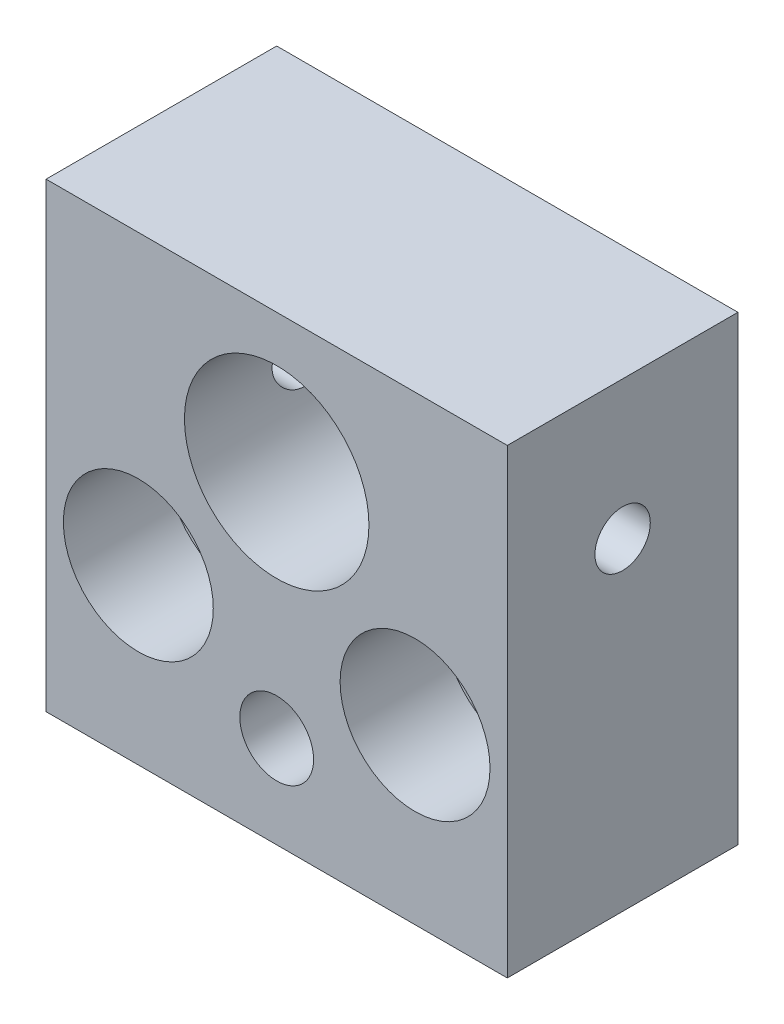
from build123d import *

# Parameters (mm, degrees)
ESQUISSE1_W                                     = 20
ESQUISSE1_H                                     = 20
ESQUISSE1_R                                     = 4
EXTRUSION1_DEPTH                                = 10
CHAMBRAGE_POUR_VIS_T_TE_CYLINDRIQUE_D           = 3.4
CHAMBRAGE_POUR_VIS_T_TE_CYLINDRIQUE_CBORE_D     = 6.5
CHAMBRAGE_POUR_VIS_T_TE_CYLINDRIQUE_CBORE_DEPTH = 4.5
TROU_TARAUD_M4X0_71_D                           = 3.2
TROU_TARAUD_M3X0_51_D                           = 2.4


with BuildPart() as part:
    # Esquisse1 → Extrusion1 (new body)
    with BuildSketch(Plane.XY):
        with Locations((0, 28.5)):
            Rectangle(ESQUISSE1_W, ESQUISSE1_H)
        with Locations((0, 32.5)):
            Circle(ESQUISSE1_R, mode=Mode.SUBTRACT)
    extrude(amount=EXTRUSION1_DEPTH)

    # Chambrage pour vis _ t_te cylindrique (through all)
    with Locations(Plane.XY.offset(10)):
        with Locations((-6, 26), (6, 26)):
            CounterBoreHole(CHAMBRAGE_POUR_VIS_T_TE_CYLINDRIQUE_D / 2, CHAMBRAGE_POUR_VIS_T_TE_CYLINDRIQUE_CBORE_D / 2, CHAMBRAGE_POUR_VIS_T_TE_CYLINDRIQUE_CBORE_DEPTH)

    # Trou taraud_ M4x0.71 (through all)
    with Locations(Plane.XY.offset(10)):
        with Locations((0, 22.5)):
            Hole(TROU_TARAUD_M4X0_71_D / 2)

    # Trou taraud_ M3x0.51 (through all)
    with Locations(Plane(origin=(10, 0, 0), x_dir=(0, 0, -1), z_dir=(1, 0, 0))):
        with Locations((-5, 32.5)):
            Hole(TROU_TARAUD_M3X0_51_D / 2)


solid = part.part
